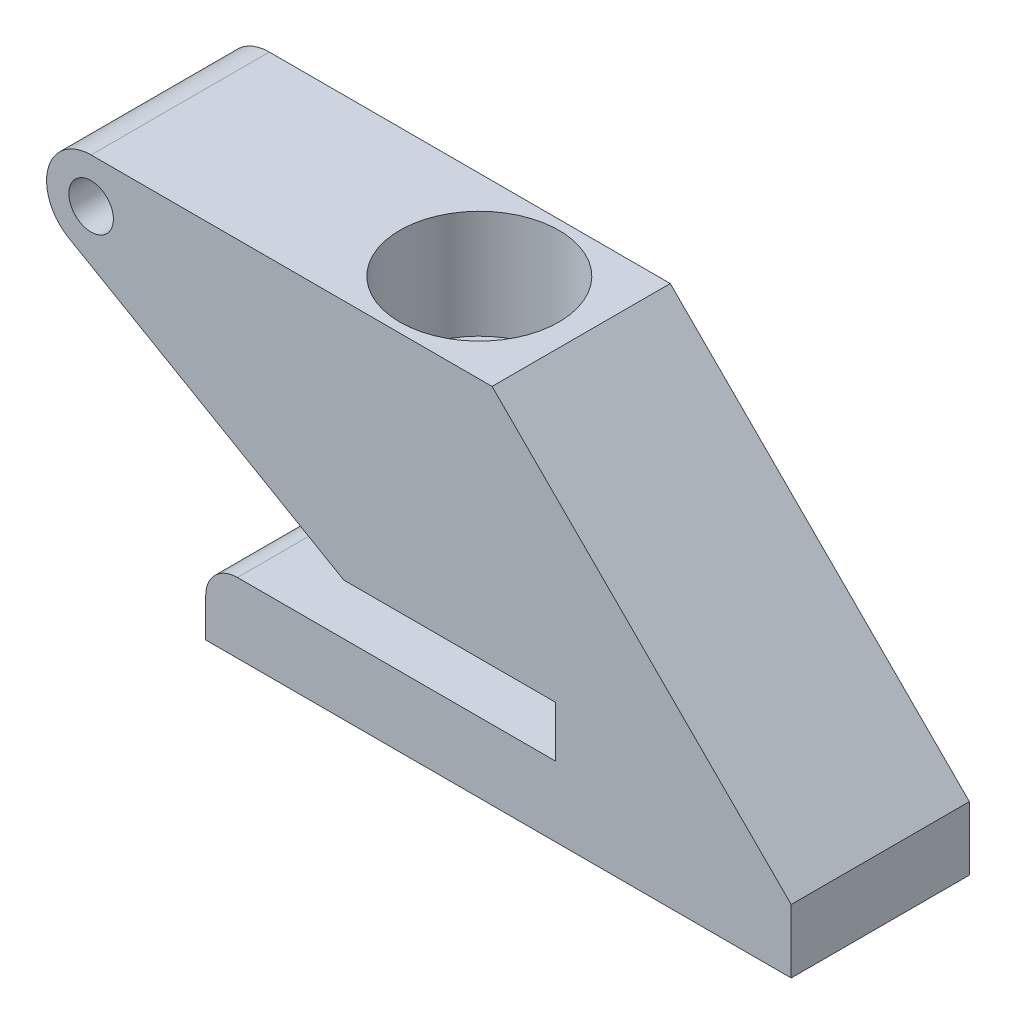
ISO-10303-21;
HEADER;
FILE_DESCRIPTION(('STEP AP214'),'2;1');
FILE_NAME('part.step','',(''),(''),'','','');
FILE_SCHEMA(('AUTOMOTIVE_DESIGN { 1 0 10303 214 1 1 1 1 }'));
ENDSEC;
DATA;
#1=APPLICATION_CONTEXT('core data for automotive mechanical design processes');
#2=APPLICATION_PROTOCOL_DEFINITION('international standard','automotive_design',2000,#1);
#3=PRODUCT_CONTEXT('',#1,'mechanical');
#4=PRODUCT('Part','Part','',(#3));
#5=PRODUCT_RELATED_PRODUCT_CATEGORY('part','',(#4));
#6=PRODUCT_DEFINITION_FORMATION('','',#4);
#7=PRODUCT_DEFINITION_CONTEXT('part definition',#1,'design');
#8=PRODUCT_DEFINITION('design','',#6,#7);
#9=PRODUCT_DEFINITION_SHAPE('','',#8);
#10=(LENGTH_UNIT() NAMED_UNIT(*) SI_UNIT(.MILLI.,.METRE.));
#11=(NAMED_UNIT(*) PLANE_ANGLE_UNIT() SI_UNIT($,.RADIAN.));
#12=(NAMED_UNIT(*) SI_UNIT($,.STERADIAN.) SOLID_ANGLE_UNIT());
#13=UNCERTAINTY_MEASURE_WITH_UNIT(LENGTH_MEASURE(1.E-05),#10,'distance_accuracy_value','');
#14=(GEOMETRIC_REPRESENTATION_CONTEXT(3) GLOBAL_UNCERTAINTY_ASSIGNED_CONTEXT((#13)) GLOBAL_UNIT_ASSIGNED_CONTEXT((#10,
#11,#12)) REPRESENTATION_CONTEXT('',''));
#15=CARTESIAN_POINT('',(0.,0.,0.));
#16=DIRECTION('',(0.,0.,1.));
#17=DIRECTION('',(1.,0.,0.));
#18=AXIS2_PLACEMENT_3D('',#15,#16,#17);
#19=CARTESIAN_POINT('',(10.5143063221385,29.7360421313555,28.));
#20=DIRECTION('',(0.,1.,0.));
#21=DIRECTION('',(0.,0.,1.));
#22=AXIS2_PLACEMENT_3D('',#19,#20,#21);
#23=PLANE('',#22);
#24=CARTESIAN_POINT('',(21.5143063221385,29.7360421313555,14.));
#25=DIRECTION('',(0.,-1.,0.));
#26=DIRECTION('',(0.,0.,-1.));
#27=AXIS2_PLACEMENT_3D('',#24,#25,#26);
#28=CIRCLE('',#27,4.19999999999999);
#29=CARTESIAN_POINT('',(21.5143063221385,29.7360421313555,9.80000000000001));
#30=VERTEX_POINT('',#29);
#31=EDGE_CURVE('E658',#30,#30,#28,.T.);
#32=ORIENTED_EDGE('',*,*,#31,.F.);
#33=EDGE_LOOP('',(#32));
#34=FACE_BOUND('',#33,.T.);
#35=CARTESIAN_POINT('',(39.5143063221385,29.7360421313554,14.));
#36=DIRECTION('',(0.,1.,0.));
#37=DIRECTION('',(0.,0.,1.));
#38=AXIS2_PLACEMENT_3D('',#35,#36,#37);
#39=CIRCLE('',#38,5.99999999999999);
#40=CARTESIAN_POINT('',(39.5143063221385,29.7360421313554,20.));
#41=VERTEX_POINT('',#40);
#42=EDGE_CURVE('E527',#41,#41,#39,.T.);
#43=ORIENTED_EDGE('',*,*,#42,.T.);
#44=EDGE_LOOP('',(#43));
#45=FACE_BOUND('',#44,.T.);
#46=DIRECTION('',(1.,0.,0.));
#47=VECTOR('',#46,1.);
#48=CARTESIAN_POINT('',(10.5143063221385,29.7360421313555,0.));
#49=LINE('',#48,#47);
#50=CARTESIAN_POINT('',(10.5143063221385,29.7360421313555,0.));
#51=VERTEX_POINT('',#50);
#52=CARTESIAN_POINT('',(102.514306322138,29.7360421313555,0.));
#53=VERTEX_POINT('',#52);
#54=EDGE_CURVE('E552',#51,#53,#49,.T.);
#55=ORIENTED_EDGE('',*,*,#54,.T.);
#56=DIRECTION('',(0.,0.,-1.));
#57=VECTOR('',#56,1.);
#58=CARTESIAN_POINT('',(102.514306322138,29.7360421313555,28.));
#59=LINE('',#58,#57);
#60=CARTESIAN_POINT('',(102.514306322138,29.7360421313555,28.));
#61=VERTEX_POINT('',#60);
#62=EDGE_CURVE('E357',#61,#53,#59,.T.);
#63=ORIENTED_EDGE('',*,*,#62,.F.);
#64=DIRECTION('',(1.,0.,0.));
#65=VECTOR('',#64,1.);
#66=CARTESIAN_POINT('',(10.5143063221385,29.7360421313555,28.));
#67=LINE('',#66,#65);
#68=CARTESIAN_POINT('',(10.5143063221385,29.7360421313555,28.));
#69=VERTEX_POINT('',#68);
#70=EDGE_CURVE('E579',#69,#61,#67,.T.);
#71=ORIENTED_EDGE('',*,*,#70,.F.);
#72=DIRECTION('',(0.,0.,-1.));
#73=VECTOR('',#72,1.);
#74=CARTESIAN_POINT('',(10.5143063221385,29.7360421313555,28.));
#75=LINE('',#74,#73);
#76=EDGE_CURVE('E11',#69,#51,#75,.T.);
#77=ORIENTED_EDGE('',*,*,#76,.T.);
#78=EDGE_LOOP('',(#55,#63,#71,#77));
#79=FACE_BOUND('',#78,.T.);
#80=CARTESIAN_POINT('',(83.5143063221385,29.7360421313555,14.));
#81=DIRECTION('',(0.,-1.,0.));
#82=DIRECTION('',(0.,0.,-1.));
#83=AXIS2_PLACEMENT_3D('',#80,#81,#82);
#84=CIRCLE('',#83,4.2);
#85=CARTESIAN_POINT('',(83.5143063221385,29.7360421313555,9.8));
#86=VERTEX_POINT('',#85);
#87=EDGE_CURVE('E669',#86,#86,#84,.T.);
#88=ORIENTED_EDGE('',*,*,#87,.F.);
#89=EDGE_LOOP('',(#88));
#90=FACE_BOUND('',#89,.T.);
#91=ADVANCED_FACE('F348',(#34,#45,#79,#90),#23,.F.);
#92=CARTESIAN_POINT('',(65.5143063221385,40.7360421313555,28.));
#93=DIRECTION('',(0.,-1.,0.));
#94=DIRECTION('',(1.,0.,0.));
#95=AXIS2_PLACEMENT_3D('',#92,#93,#94);
#96=PLANE('',#95);
#97=CARTESIAN_POINT('',(39.5143063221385,40.7360421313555,14.));
#98=DIRECTION('',(0.,-1.,0.));
#99=DIRECTION('',(1.,0.,0.));
#100=AXIS2_PLACEMENT_3D('',#97,#98,#99);
#101=CIRCLE('',#100,5.99999999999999);
#102=CARTESIAN_POINT('',(45.5143063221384,40.7360421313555,14.));
#103=VERTEX_POINT('',#102);
#104=EDGE_CURVE('E352',#103,#103,#101,.F.);
#105=ORIENTED_EDGE('',*,*,#104,.F.);
#106=EDGE_LOOP('',(#105));
#107=FACE_BOUND('',#106,.T.);
#108=DIRECTION('',(-1.,0.,0.));
#109=VECTOR('',#108,1.);
#110=CARTESIAN_POINT('',(65.5143063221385,40.7360421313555,0.));
#111=LINE('',#110,#109);
#112=CARTESIAN_POINT('',(65.5143063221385,40.7360421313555,0.));
#113=VERTEX_POINT('',#112);
#114=CARTESIAN_POINT('',(15.5143063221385,40.7360421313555,0.));
#115=VERTEX_POINT('',#114);
#116=EDGE_CURVE('E570',#113,#115,#111,.T.);
#117=ORIENTED_EDGE('',*,*,#116,.T.);
#118=DIRECTION('',(0.,0.,-1.));
#119=VECTOR('',#118,1.);
#120=CARTESIAN_POINT('',(15.5143063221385,40.7360421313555,28.));
#121=LINE('',#120,#119);
#122=CARTESIAN_POINT('',(15.5143063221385,40.7360421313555,28.));
#123=VERTEX_POINT('',#122);
#124=EDGE_CURVE('E600',#123,#115,#121,.T.);
#125=ORIENTED_EDGE('',*,*,#124,.F.);
#126=DIRECTION('',(-1.,0.,0.));
#127=VECTOR('',#126,1.);
#128=CARTESIAN_POINT('',(65.5143063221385,40.7360421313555,28.));
#129=LINE('',#128,#127);
#130=CARTESIAN_POINT('',(65.5143063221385,40.7360421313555,28.));
#131=VERTEX_POINT('',#130);
#132=EDGE_CURVE('E372',#131,#123,#129,.T.);
#133=ORIENTED_EDGE('',*,*,#132,.F.);
#134=DIRECTION('',(0.,0.,-1.));
#135=VECTOR('',#134,1.);
#136=CARTESIAN_POINT('',(65.5143063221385,40.7360421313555,28.));
#137=LINE('',#136,#135);
#138=EDGE_CURVE('E602',#131,#113,#137,.T.);
#139=ORIENTED_EDGE('',*,*,#138,.T.);
#140=EDGE_LOOP('',(#117,#125,#133,#139));
#141=FACE_BOUND('',#140,.T.);
#142=CARTESIAN_POINT('',(21.5143063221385,40.7360421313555,14.));
#143=DIRECTION('',(0.,-1.,0.));
#144=DIRECTION('',(1.,0.,0.));
#145=AXIS2_PLACEMENT_3D('',#142,#143,#144);
#146=CIRCLE('',#145,4.2);
#147=CARTESIAN_POINT('',(25.7143063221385,40.7360421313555,14.));
#148=VERTEX_POINT('',#147);
#149=EDGE_CURVE('E657',#148,#148,#146,.F.);
#150=ORIENTED_EDGE('',*,*,#149,.F.);
#151=EDGE_LOOP('',(#150));
#152=FACE_BOUND('',#151,.T.);
#153=ADVANCED_FACE('F453',(#107,#141,#152),#96,.F.);
#154=CARTESIAN_POINT('',(55.5143063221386,86.7360421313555,28.));
#155=DIRECTION('',(0.,-1.,0.));
#156=DIRECTION('',(1.,0.,0.));
#157=AXIS2_PLACEMENT_3D('',#154,#155,#156);
#158=PLANE('',#157);
#159=DIRECTION('',(-1.,0.,0.));
#160=VECTOR('',#159,1.);
#161=CARTESIAN_POINT('',(55.5143063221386,86.7360421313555,0.));
#162=LINE('',#161,#160);
#163=CARTESIAN_POINT('',(55.5143063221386,86.7360421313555,0.));
#164=VERTEX_POINT('',#163);
#165=CARTESIAN_POINT('',(-7.48569367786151,86.7360421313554,0.));
#166=VERTEX_POINT('',#165);
#167=EDGE_CURVE('E558',#164,#166,#162,.T.);
#168=ORIENTED_EDGE('',*,*,#167,.T.);
#169=DIRECTION('',(0.,0.,-1.));
#170=VECTOR('',#169,1.);
#171=CARTESIAN_POINT('',(-7.48569367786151,86.7360421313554,28.));
#172=LINE('',#171,#170);
#173=CARTESIAN_POINT('',(-7.48569367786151,86.7360421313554,28.));
#174=VERTEX_POINT('',#173);
#175=EDGE_CURVE('E612',#174,#166,#172,.T.);
#176=ORIENTED_EDGE('',*,*,#175,.F.);
#177=DIRECTION('',(-1.,0.,0.));
#178=VECTOR('',#177,1.);
#179=CARTESIAN_POINT('',(55.5143063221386,86.7360421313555,28.));
#180=LINE('',#179,#178);
#181=CARTESIAN_POINT('',(55.5143063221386,86.7360421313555,28.));
#182=VERTEX_POINT('',#181);
#183=EDGE_CURVE('E585',#182,#174,#180,.T.);
#184=ORIENTED_EDGE('',*,*,#183,.F.);
#185=DIRECTION('',(0.,0.,-1.));
#186=VECTOR('',#185,1.);
#187=CARTESIAN_POINT('',(55.5143063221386,86.7360421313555,28.));
#188=LINE('',#187,#186);
#189=EDGE_CURVE('E615',#182,#164,#188,.T.);
#190=ORIENTED_EDGE('',*,*,#189,.T.);
#191=EDGE_LOOP('',(#168,#176,#184,#190));
#192=FACE_BOUND('',#191,.T.);
#193=CARTESIAN_POINT('',(39.5143063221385,86.7360421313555,14.));
#194=DIRECTION('',(0.,1.,0.));
#195=DIRECTION('',(0.,0.,1.));
#196=AXIS2_PLACEMENT_3D('',#193,#194,#195);
#197=CIRCLE('',#196,12.5);
#198=CARTESIAN_POINT('',(39.5143063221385,86.7360421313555,26.5));
#199=VERTEX_POINT('',#198);
#200=EDGE_CURVE('E531',#199,#199,#197,.T.);
#201=ORIENTED_EDGE('',*,*,#200,.F.);
#202=EDGE_LOOP('',(#201));
#203=FACE_BOUND('',#202,.T.);
#204=ADVANCED_FACE('F458',(#192,#203),#158,.F.);
#205=CARTESIAN_POINT('',(65.5143063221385,48.7360421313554,28.));
#206=DIRECTION('',(0.,-1.,0.));
#207=DIRECTION('',(1.,0.,0.));
#208=AXIS2_PLACEMENT_3D('',#205,#206,#207);
#209=PLANE('',#208);
#210=DIRECTION('',(-1.,0.,0.));
#211=VECTOR('',#210,1.);
#212=CARTESIAN_POINT('',(65.5143063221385,48.7360421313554,0.));
#213=LINE('',#212,#211);
#214=CARTESIAN_POINT('',(65.5143063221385,48.7360421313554,0.));
#215=VERTEX_POINT('',#214);
#216=CARTESIAN_POINT('',(32.2078813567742,48.7360421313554,0.));
#217=VERTEX_POINT('',#216);
#218=EDGE_CURVE('E565',#215,#217,#213,.T.);
#219=ORIENTED_EDGE('',*,*,#218,.F.);
#220=DIRECTION('',(0.,0.,-1.));
#221=VECTOR('',#220,1.);
#222=CARTESIAN_POINT('',(65.5143063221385,48.7360421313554,28.));
#223=LINE('',#222,#221);
#224=CARTESIAN_POINT('',(65.5143063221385,48.7360421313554,28.));
#225=VERTEX_POINT('',#224);
#226=EDGE_CURVE('E605',#225,#215,#223,.T.);
#227=ORIENTED_EDGE('',*,*,#226,.F.);
#228=DIRECTION('',(-1.,0.,0.));
#229=VECTOR('',#228,1.);
#230=CARTESIAN_POINT('',(65.5143063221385,48.7360421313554,28.));
#231=LINE('',#230,#229);
#232=CARTESIAN_POINT('',(32.2078813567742,48.7360421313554,28.));
#233=VERTEX_POINT('',#232);
#234=EDGE_CURVE('E591',#225,#233,#231,.T.);
#235=ORIENTED_EDGE('',*,*,#234,.T.);
#236=DIRECTION('',(0.,0.,-1.));
#237=VECTOR('',#236,1.);
#238=CARTESIAN_POINT('',(32.2078813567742,48.7360421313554,28.));
#239=LINE('',#238,#237);
#240=EDGE_CURVE('E607',#233,#217,#239,.T.);
#241=ORIENTED_EDGE('',*,*,#240,.T.);
#242=EDGE_LOOP('',(#219,#227,#235,#241));
#243=FACE_BOUND('',#242,.T.);
#244=CARTESIAN_POINT('',(39.5143063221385,48.7360421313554,14.));
#245=DIRECTION('',(0.,-1.,0.));
#246=DIRECTION('',(1.,0.,0.));
#247=AXIS2_PLACEMENT_3D('',#244,#245,#246);
#248=CIRCLE('',#247,5.99999999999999);
#249=CARTESIAN_POINT('',(45.5143063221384,48.7360421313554,14.));
#250=VERTEX_POINT('',#249);
#251=EDGE_CURVE('E530',#250,#250,#248,.F.);
#252=ORIENTED_EDGE('',*,*,#251,.T.);
#253=EDGE_LOOP('',(#252));
#254=FACE_BOUND('',#253,.T.);
#255=ADVANCED_FACE('F475',(#243,#254),#209,.T.);
#256=CARTESIAN_POINT('',(-7.48569367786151,79.7360421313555,28.));
#257=DIRECTION('',(0.,0.,1.));
#258=DIRECTION('',(1.,0.,0.));
#259=AXIS2_PLACEMENT_3D('',#256,#257,#258);
#260=PLANE('',#259);
#261=DIRECTION('',(0.,-1.,0.));
#262=VECTOR('',#261,1.);
#263=CARTESIAN_POINT('',(10.5143063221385,35.7360421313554,28.));
#264=LINE('',#263,#262);
#265=CARTESIAN_POINT('',(10.5143063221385,35.7360421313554,28.));
#266=VERTEX_POINT('',#265);
#267=EDGE_CURVE('E576',#266,#69,#264,.T.);
#268=ORIENTED_EDGE('',*,*,#267,.T.);
#269=ORIENTED_EDGE('',*,*,#70,.T.);
#270=DIRECTION('',(0.,1.,0.));
#271=VECTOR('',#270,1.);
#272=CARTESIAN_POINT('',(102.514306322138,29.7360421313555,28.));
#273=LINE('',#272,#271);
#274=CARTESIAN_POINT('',(102.514306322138,39.7360421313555,28.));
#275=VERTEX_POINT('',#274);
#276=EDGE_CURVE('E581',#61,#275,#273,.T.);
#277=ORIENTED_EDGE('',*,*,#276,.T.);
#278=DIRECTION('',(-0.707106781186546,0.707106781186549,0.));
#279=VECTOR('',#278,1.);
#280=CARTESIAN_POINT('',(102.514306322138,39.7360421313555,28.));
#281=LINE('',#280,#279);
#282=EDGE_CURVE('E583',#275,#182,#281,.T.);
#283=ORIENTED_EDGE('',*,*,#282,.T.);
#284=ORIENTED_EDGE('',*,*,#183,.T.);
#285=CARTESIAN_POINT('',(-7.48569367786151,79.7360421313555,28.));
#286=DIRECTION('',(0.,0.,1.));
#287=DIRECTION('',(1.,0.,0.));
#288=AXIS2_PLACEMENT_3D('',#285,#286,#287);
#289=CIRCLE('',#288,7.00000000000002);
#290=CARTESIAN_POINT('',(-10.9856936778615,73.6738643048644,28.));
#291=VERTEX_POINT('',#290);
#292=EDGE_CURVE('E587',#174,#291,#289,.T.);
#293=ORIENTED_EDGE('',*,*,#292,.T.);
#294=DIRECTION('',(0.866025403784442,-0.499999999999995,0.));
#295=VECTOR('',#294,1.);
#296=CARTESIAN_POINT('',(-10.9856936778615,73.6738643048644,28.));
#297=LINE('',#296,#295);
#298=EDGE_CURVE('E589',#291,#233,#297,.T.);
#299=ORIENTED_EDGE('',*,*,#298,.T.);
#300=ORIENTED_EDGE('',*,*,#234,.F.);
#301=DIRECTION('',(0.,-1.,0.));
#302=VECTOR('',#301,1.);
#303=CARTESIAN_POINT('',(65.5143063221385,48.7360421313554,28.));
#304=LINE('',#303,#302);
#305=EDGE_CURVE('E594',#225,#131,#304,.T.);
#306=ORIENTED_EDGE('',*,*,#305,.T.);
#307=ORIENTED_EDGE('',*,*,#132,.T.);
#308=CARTESIAN_POINT('',(15.5143063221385,35.7360421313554,28.));
#309=DIRECTION('',(0.,0.,-1.));
#310=DIRECTION('',(-1.,0.,0.));
#311=AXIS2_PLACEMENT_3D('',#308,#309,#310);
#312=CIRCLE('',#311,5.00000000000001);
#313=EDGE_CURVE('E597',#266,#123,#312,.T.);
#314=ORIENTED_EDGE('',*,*,#313,.F.);
#315=EDGE_LOOP('',(#268,#269,#277,#283,#284,#293,#299,#300,#306,#307,#314));
#316=FACE_BOUND('',#315,.T.);
#317=CARTESIAN_POINT('',(-7.48569367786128,79.7360421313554,28.));
#318=DIRECTION('',(0.,0.,1.));
#319=DIRECTION('',(1.,0.,0.));
#320=AXIS2_PLACEMENT_3D('',#317,#318,#319);
#321=CIRCLE('',#320,3.5);
#322=CARTESIAN_POINT('',(-3.98569367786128,79.7360421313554,28.));
#323=VERTEX_POINT('',#322);
#324=EDGE_CURVE('E546',#323,#323,#321,.T.);
#325=ORIENTED_EDGE('',*,*,#324,.F.);
#326=EDGE_LOOP('',(#325));
#327=FACE_BOUND('',#326,.T.);
#328=ADVANCED_FACE('F487',(#316,#327),#260,.T.);
#329=CARTESIAN_POINT('',(-7.48569367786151,79.7360421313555,0.));
#330=DIRECTION('',(0.,0.,1.));
#331=DIRECTION('',(1.,0.,0.));
#332=AXIS2_PLACEMENT_3D('',#329,#330,#331);
#333=PLANE('',#332);
#334=DIRECTION('',(0.,-1.,0.));
#335=VECTOR('',#334,1.);
#336=CARTESIAN_POINT('',(10.5143063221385,35.7360421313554,0.));
#337=LINE('',#336,#335);
#338=CARTESIAN_POINT('',(10.5143063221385,35.7360421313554,0.));
#339=VERTEX_POINT('',#338);
#340=EDGE_CURVE('E549',#339,#51,#337,.T.);
#341=ORIENTED_EDGE('',*,*,#340,.F.);
#342=CARTESIAN_POINT('',(15.5143063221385,35.7360421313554,0.));
#343=DIRECTION('',(0.,0.,-1.));
#344=DIRECTION('',(-1.,0.,0.));
#345=AXIS2_PLACEMENT_3D('',#342,#343,#344);
#346=CIRCLE('',#345,5.00000000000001);
#347=EDGE_CURVE('E573',#339,#115,#346,.T.);
#348=ORIENTED_EDGE('',*,*,#347,.T.);
#349=ORIENTED_EDGE('',*,*,#116,.F.);
#350=DIRECTION('',(0.,-1.,0.));
#351=VECTOR('',#350,1.);
#352=CARTESIAN_POINT('',(65.5143063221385,48.7360421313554,0.));
#353=LINE('',#352,#351);
#354=EDGE_CURVE('E568',#215,#113,#353,.T.);
#355=ORIENTED_EDGE('',*,*,#354,.F.);
#356=ORIENTED_EDGE('',*,*,#218,.T.);
#357=DIRECTION('',(0.866025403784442,-0.499999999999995,0.));
#358=VECTOR('',#357,1.);
#359=CARTESIAN_POINT('',(-10.9856936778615,73.6738643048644,0.));
#360=LINE('',#359,#358);
#361=CARTESIAN_POINT('',(-10.9856936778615,73.6738643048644,0.));
#362=VERTEX_POINT('',#361);
#363=EDGE_CURVE('E562',#362,#217,#360,.T.);
#364=ORIENTED_EDGE('',*,*,#363,.F.);
#365=CARTESIAN_POINT('',(-7.48569367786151,79.7360421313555,0.));
#366=DIRECTION('',(0.,0.,1.));
#367=DIRECTION('',(1.,0.,0.));
#368=AXIS2_PLACEMENT_3D('',#365,#366,#367);
#369=CIRCLE('',#368,7.00000000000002);
#370=EDGE_CURVE('E560',#166,#362,#369,.T.);
#371=ORIENTED_EDGE('',*,*,#370,.F.);
#372=ORIENTED_EDGE('',*,*,#167,.F.);
#373=DIRECTION('',(-0.707106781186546,0.707106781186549,0.));
#374=VECTOR('',#373,1.);
#375=CARTESIAN_POINT('',(102.514306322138,39.7360421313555,0.));
#376=LINE('',#375,#374);
#377=CARTESIAN_POINT('',(102.514306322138,39.7360421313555,0.));
#378=VERTEX_POINT('',#377);
#379=EDGE_CURVE('E556',#378,#164,#376,.T.);
#380=ORIENTED_EDGE('',*,*,#379,.F.);
#381=DIRECTION('',(0.,1.,0.));
#382=VECTOR('',#381,1.);
#383=CARTESIAN_POINT('',(102.514306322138,29.7360421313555,0.));
#384=LINE('',#383,#382);
#385=EDGE_CURVE('E554',#53,#378,#384,.T.);
#386=ORIENTED_EDGE('',*,*,#385,.F.);
#387=ORIENTED_EDGE('',*,*,#54,.F.);
#388=EDGE_LOOP('',(#341,#348,#349,#355,#356,#364,#371,#372,#380,#386,#387));
#389=FACE_BOUND('',#388,.T.);
#390=CARTESIAN_POINT('',(-7.48569367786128,79.7360421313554,0.));
#391=DIRECTION('',(0.,0.,1.));
#392=DIRECTION('',(1.,0.,0.));
#393=AXIS2_PLACEMENT_3D('',#390,#391,#392);
#394=CIRCLE('',#393,3.5);
#395=CARTESIAN_POINT('',(-3.98569367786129,79.7360421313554,0.));
#396=VERTEX_POINT('',#395);
#397=EDGE_CURVE('E533',#396,#396,#394,.T.);
#398=ORIENTED_EDGE('',*,*,#397,.T.);
#399=EDGE_LOOP('',(#398));
#400=FACE_BOUND('',#399,.T.);
#401=ADVANCED_FACE('F498',(#389,#400),#333,.F.);
#402=CARTESIAN_POINT('',(10.5143063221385,35.7360421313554,28.));
#403=DIRECTION('',(1.,0.,0.));
#404=DIRECTION('',(0.,0.,-1.));
#405=AXIS2_PLACEMENT_3D('',#402,#403,#404);
#406=PLANE('',#405);
#407=ORIENTED_EDGE('',*,*,#340,.T.);
#408=ORIENTED_EDGE('',*,*,#76,.F.);
#409=ORIENTED_EDGE('',*,*,#267,.F.);
#410=DIRECTION('',(0.,0.,-1.));
#411=VECTOR('',#410,1.);
#412=CARTESIAN_POINT('',(10.5143063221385,35.7360421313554,28.));
#413=LINE('',#412,#411);
#414=EDGE_CURVE('E364',#266,#339,#413,.T.);
#415=ORIENTED_EDGE('',*,*,#414,.T.);
#416=EDGE_LOOP('',(#407,#408,#409,#415));
#417=FACE_BOUND('',#416,.T.);
#418=ADVANCED_FACE('F350',(#417),#406,.F.);
#419=CARTESIAN_POINT('',(102.514306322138,29.7360421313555,28.));
#420=DIRECTION('',(-1.,0.,0.));
#421=DIRECTION('',(0.,-1.,0.));
#422=AXIS2_PLACEMENT_3D('',#419,#420,#421);
#423=PLANE('',#422);
#424=ORIENTED_EDGE('',*,*,#385,.T.);
#425=DIRECTION('',(0.,0.,-1.));
#426=VECTOR('',#425,1.);
#427=CARTESIAN_POINT('',(102.514306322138,39.7360421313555,28.));
#428=LINE('',#427,#426);
#429=EDGE_CURVE('E618',#275,#378,#428,.T.);
#430=ORIENTED_EDGE('',*,*,#429,.F.);
#431=ORIENTED_EDGE('',*,*,#276,.F.);
#432=ORIENTED_EDGE('',*,*,#62,.T.);
#433=EDGE_LOOP('',(#424,#430,#431,#432));
#434=FACE_BOUND('',#433,.T.);
#435=ADVANCED_FACE('F464',(#434),#423,.F.);
#436=CARTESIAN_POINT('',(102.514306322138,39.7360421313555,28.));
#437=DIRECTION('',(-0.707106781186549,-0.707106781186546,0.));
#438=DIRECTION('',(0.707106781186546,-0.707106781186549,0.));
#439=AXIS2_PLACEMENT_3D('',#436,#437,#438);
#440=PLANE('',#439);
#441=ORIENTED_EDGE('',*,*,#379,.T.);
#442=ORIENTED_EDGE('',*,*,#189,.F.);
#443=ORIENTED_EDGE('',*,*,#282,.F.);
#444=ORIENTED_EDGE('',*,*,#429,.T.);
#445=EDGE_LOOP('',(#441,#442,#443,#444));
#446=FACE_BOUND('',#445,.T.);
#447=ADVANCED_FACE('F467',(#446),#440,.F.);
#448=CARTESIAN_POINT('',(-7.48569367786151,79.7360421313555,28.));
#449=DIRECTION('',(0.,0.,-1.));
#450=DIRECTION('',(-1.,0.,0.));
#451=AXIS2_PLACEMENT_3D('',#448,#449,#450);
#452=CYLINDRICAL_SURFACE('',#451,7.00000000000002);
#453=ORIENTED_EDGE('',*,*,#370,.T.);
#454=DIRECTION('',(0.,0.,-1.));
#455=VECTOR('',#454,1.);
#456=CARTESIAN_POINT('',(-10.9856936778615,73.6738643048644,28.));
#457=LINE('',#456,#455);
#458=EDGE_CURVE('E609',#291,#362,#457,.T.);
#459=ORIENTED_EDGE('',*,*,#458,.F.);
#460=ORIENTED_EDGE('',*,*,#292,.F.);
#461=ORIENTED_EDGE('',*,*,#175,.T.);
#462=EDGE_LOOP('',(#453,#459,#460,#461));
#463=FACE_BOUND('',#462,.T.);
#464=ADVANCED_FACE('F471',(#463),#452,.T.);
#465=CARTESIAN_POINT('',(-10.9856936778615,73.6738643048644,28.));
#466=DIRECTION('',(0.499999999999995,0.866025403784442,0.));
#467=DIRECTION('',(-0.866025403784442,0.499999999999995,0.));
#468=AXIS2_PLACEMENT_3D('',#465,#466,#467);
#469=PLANE('',#468);
#470=ORIENTED_EDGE('',*,*,#363,.T.);
#471=ORIENTED_EDGE('',*,*,#240,.F.);
#472=ORIENTED_EDGE('',*,*,#298,.F.);
#473=ORIENTED_EDGE('',*,*,#458,.T.);
#474=EDGE_LOOP('',(#470,#471,#472,#473));
#475=FACE_BOUND('',#474,.T.);
#476=ADVANCED_FACE('F479',(#475),#469,.F.);
#477=CARTESIAN_POINT('',(65.5143063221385,48.7360421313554,28.));
#478=DIRECTION('',(1.,0.,0.));
#479=DIRECTION('',(0.,1.,0.));
#480=AXIS2_PLACEMENT_3D('',#477,#478,#479);
#481=PLANE('',#480);
#482=ORIENTED_EDGE('',*,*,#354,.T.);
#483=ORIENTED_EDGE('',*,*,#138,.F.);
#484=ORIENTED_EDGE('',*,*,#305,.F.);
#485=ORIENTED_EDGE('',*,*,#226,.T.);
#486=EDGE_LOOP('',(#482,#483,#484,#485));
#487=FACE_BOUND('',#486,.T.);
#488=ADVANCED_FACE('F483',(#487),#481,.F.);
#489=CARTESIAN_POINT('',(15.5143063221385,35.7360421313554,28.));
#490=DIRECTION('',(0.,0.,-1.));
#491=DIRECTION('',(-1.,0.,0.));
#492=AXIS2_PLACEMENT_3D('',#489,#490,#491);
#493=CYLINDRICAL_SURFACE('',#492,5.00000000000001);
#494=ORIENTED_EDGE('',*,*,#347,.F.);
#495=ORIENTED_EDGE('',*,*,#414,.F.);
#496=ORIENTED_EDGE('',*,*,#313,.T.);
#497=ORIENTED_EDGE('',*,*,#124,.T.);
#498=EDGE_LOOP('',(#494,#495,#496,#497));
#499=FACE_BOUND('',#498,.T.);
#500=ADVANCED_FACE('F490',(#499),#493,.T.);
#501=CARTESIAN_POINT('',(-7.48569367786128,79.7360421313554,28.));
#502=DIRECTION('',(0.,0.,1.));
#503=DIRECTION('',(1.,0.,0.));
#504=AXIS2_PLACEMENT_3D('',#501,#502,#503);
#505=CYLINDRICAL_SURFACE('',#504,3.5);
#506=ORIENTED_EDGE('',*,*,#324,.T.);
#507=EDGE_LOOP('',(#506));
#508=FACE_BOUND('',#507,.T.);
#509=ORIENTED_EDGE('',*,*,#397,.F.);
#510=EDGE_LOOP('',(#509));
#511=FACE_BOUND('',#510,.T.);
#512=ADVANCED_FACE('F495',(#508,#511),#505,.F.);
#513=CARTESIAN_POINT('',(39.5143063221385,86.7360421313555,14.));
#514=DIRECTION('',(0.,1.,0.));
#515=DIRECTION('',(0.,0.,1.));
#516=AXIS2_PLACEMENT_3D('',#513,#514,#515);
#517=CYLINDRICAL_SURFACE('',#516,5.99999999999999);
#518=ORIENTED_EDGE('',*,*,#42,.F.);
#519=EDGE_LOOP('',(#518));
#520=FACE_BOUND('',#519,.T.);
#521=ORIENTED_EDGE('',*,*,#104,.T.);
#522=EDGE_LOOP('',(#521));
#523=FACE_BOUND('',#522,.T.);
#524=ADVANCED_FACE('F504',(#520,#523),#517,.F.);
#525=CARTESIAN_POINT('',(39.5143063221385,86.7360421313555,14.));
#526=DIRECTION('',(0.,1.,0.));
#527=DIRECTION('',(0.,0.,1.));
#528=AXIS2_PLACEMENT_3D('',#525,#526,#527);
#529=CYLINDRICAL_SURFACE('',#528,12.5);
#530=ORIENTED_EDGE('',*,*,#200,.T.);
#531=EDGE_LOOP('',(#530));
#532=FACE_BOUND('',#531,.T.);
#533=CARTESIAN_POINT('',(39.5143063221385,69.7360421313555,14.));
#534=DIRECTION('',(0.,1.,0.));
#535=DIRECTION('',(0.,0.,1.));
#536=AXIS2_PLACEMENT_3D('',#533,#534,#535);
#537=CIRCLE('',#536,12.5);
#538=CARTESIAN_POINT('',(39.5143063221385,69.7360421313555,26.5));
#539=VERTEX_POINT('',#538);
#540=EDGE_CURVE('E536',#539,#539,#537,.T.);
#541=ORIENTED_EDGE('',*,*,#540,.F.);
#542=EDGE_LOOP('',(#541));
#543=FACE_BOUND('',#542,.T.);
#544=ADVANCED_FACE('F506',(#532,#543),#529,.F.);
#545=CARTESIAN_POINT('',(45.5143063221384,69.7360421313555,14.));
#546=DIRECTION('',(0.,1.,0.));
#547=DIRECTION('',(0.,0.,1.));
#548=AXIS2_PLACEMENT_3D('',#545,#546,#547);
#549=PLANE('',#548);
#550=ORIENTED_EDGE('',*,*,#540,.T.);
#551=EDGE_LOOP('',(#550));
#552=FACE_BOUND('',#551,.T.);
#553=CARTESIAN_POINT('',(39.5143063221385,69.7360421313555,14.));
#554=DIRECTION('',(0.,1.,0.));
#555=DIRECTION('',(0.,0.,1.));
#556=AXIS2_PLACEMENT_3D('',#553,#554,#555);
#557=CIRCLE('',#556,5.99999999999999);
#558=CARTESIAN_POINT('',(39.5143063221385,69.7360421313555,20.));
#559=VERTEX_POINT('',#558);
#560=EDGE_CURVE('E540',#559,#559,#557,.T.);
#561=ORIENTED_EDGE('',*,*,#560,.F.);
#562=EDGE_LOOP('',(#561));
#563=FACE_BOUND('',#562,.T.);
#564=ADVANCED_FACE('F509',(#552,#563),#549,.T.);
#565=ORIENTED_EDGE('',*,*,#251,.F.);
#566=EDGE_LOOP('',(#565));
#567=FACE_BOUND('',#566,.T.);
#568=ORIENTED_EDGE('',*,*,#560,.T.);
#569=EDGE_LOOP('',(#568));
#570=FACE_BOUND('',#569,.T.);
#571=ADVANCED_FACE('F449',(#567,#570),#517,.F.);
#572=CARTESIAN_POINT('',(21.5143063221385,29.7360421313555,14.));
#573=DIRECTION('',(0.,-1.,0.));
#574=DIRECTION('',(0.,0.,-1.));
#575=AXIS2_PLACEMENT_3D('',#572,#573,#574);
#576=CYLINDRICAL_SURFACE('',#575,4.2);
#577=ORIENTED_EDGE('',*,*,#149,.T.);
#578=EDGE_LOOP('',(#577));
#579=FACE_BOUND('',#578,.T.);
#580=ORIENTED_EDGE('',*,*,#31,.T.);
#581=EDGE_LOOP('',(#580));
#582=FACE_BOUND('',#581,.T.);
#583=ADVANCED_FACE('F438',(#579,#582),#576,.F.);
#584=CARTESIAN_POINT('',(83.5143063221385,54.2596567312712,14.));
#585=DIRECTION('',(0.,-1.,0.));
#586=DIRECTION('',(0.,0.,-1.));
#587=AXIS2_PLACEMENT_3D('',#584,#585,#586);
#588=CONICAL_SURFACE('',#587,0.,1.02974425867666);
#589=CARTESIAN_POINT('',(83.5143063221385,51.7360421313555,14.));
#590=DIRECTION('',(0.,-1.,0.));
#591=DIRECTION('',(0.,0.,-1.));
#592=AXIS2_PLACEMENT_3D('',#589,#590,#591);
#593=CIRCLE('',#592,4.20000000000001);
#594=CARTESIAN_POINT('',(83.5143063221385,51.7360421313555,9.79999999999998));
#595=VERTEX_POINT('',#594);
#596=EDGE_CURVE('E662',#595,#595,#593,.T.);
#597=ORIENTED_EDGE('',*,*,#596,.T.);
#598=EDGE_LOOP('',(#597));
#599=FACE_BOUND('',#598,.T.);
#600=CARTESIAN_POINT('',(83.5143063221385,54.2596567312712,14.));
#601=VERTEX_POINT('',#600);
#602=VERTEX_LOOP('',#601);
#603=FACE_BOUND('',#602,.T.);
#604=ADVANCED_FACE('F435',(#599,#603),#588,.F.);
#605=CARTESIAN_POINT('',(83.5143063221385,29.7360421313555,14.));
#606=DIRECTION('',(0.,-1.,0.));
#607=DIRECTION('',(0.,0.,-1.));
#608=AXIS2_PLACEMENT_3D('',#605,#606,#607);
#609=CYLINDRICAL_SURFACE('',#608,4.2);
#610=ORIENTED_EDGE('',*,*,#87,.T.);
#611=EDGE_LOOP('',(#610));
#612=FACE_BOUND('',#611,.T.);
#613=ORIENTED_EDGE('',*,*,#596,.F.);
#614=EDGE_LOOP('',(#613));
#615=FACE_BOUND('',#614,.T.);
#616=ADVANCED_FACE('F437',(#612,#615),#609,.F.);
#617=CLOSED_SHELL('',(#91,#153,#204,#255,#328,#401,#418,#435,#447,#464,#476,#488,#500,#512,#524,
#544,#564,#571,#583,#604,#616));
#618=MANIFOLD_SOLID_BREP('B2',#617);
#619=ADVANCED_BREP_SHAPE_REPRESENTATION('',(#18,#618),#14);
#620=SHAPE_DEFINITION_REPRESENTATION(#9,#619);
ENDSEC;
END-ISO-10303-21;
